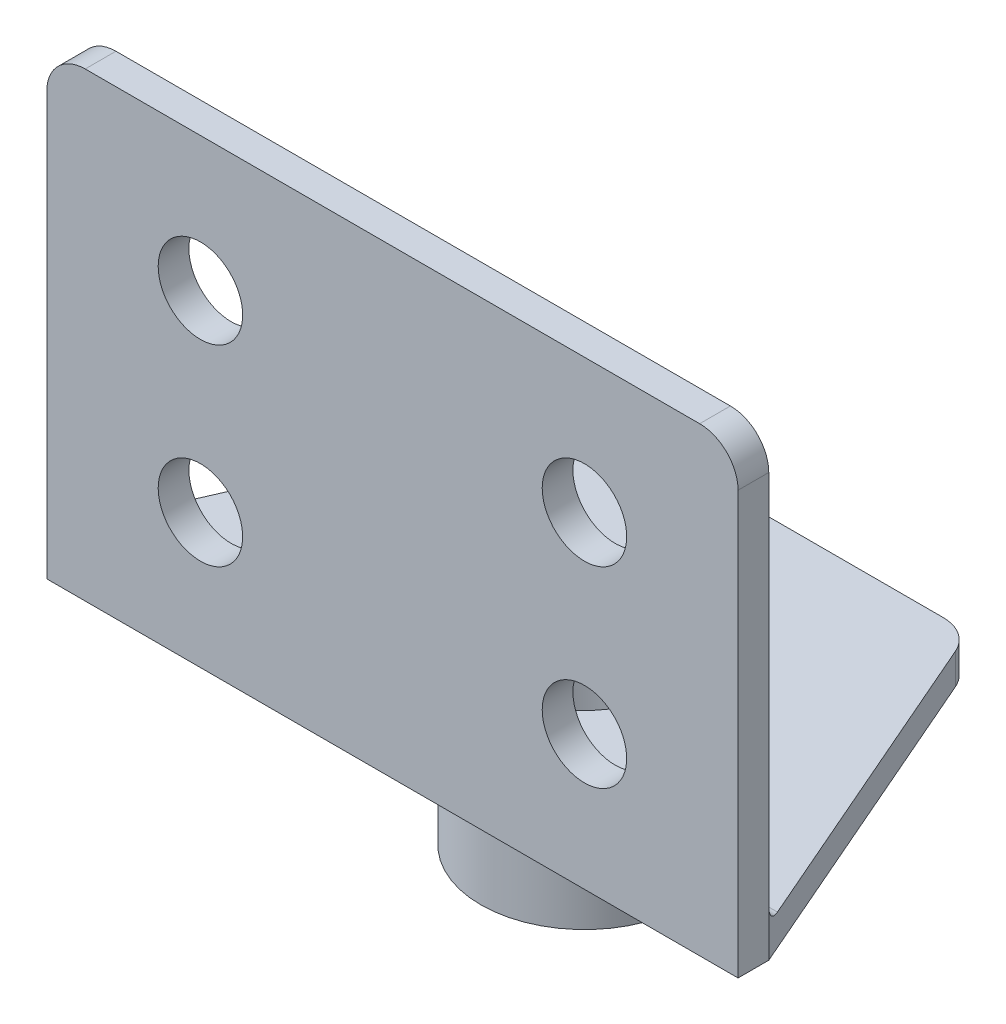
ISO-10303-21;
HEADER;
FILE_DESCRIPTION(('STEP AP214'),'2;1');
FILE_NAME('part.step','',(''),(''),'','','');
FILE_SCHEMA(('AUTOMOTIVE_DESIGN { 1 0 10303 214 1 1 1 1 }'));
ENDSEC;
DATA;
#1=APPLICATION_CONTEXT('core data for automotive mechanical design processes');
#2=APPLICATION_PROTOCOL_DEFINITION('international standard','automotive_design',2000,#1);
#3=PRODUCT_CONTEXT('',#1,'mechanical');
#4=PRODUCT('Part','Part','',(#3));
#5=PRODUCT_RELATED_PRODUCT_CATEGORY('part','',(#4));
#6=PRODUCT_DEFINITION_FORMATION('','',#4);
#7=PRODUCT_DEFINITION_CONTEXT('part definition',#1,'design');
#8=PRODUCT_DEFINITION('design','',#6,#7);
#9=PRODUCT_DEFINITION_SHAPE('','',#8);
#10=(LENGTH_UNIT() NAMED_UNIT(*) SI_UNIT(.MILLI.,.METRE.));
#11=(NAMED_UNIT(*) PLANE_ANGLE_UNIT() SI_UNIT($,.RADIAN.));
#12=(NAMED_UNIT(*) SI_UNIT($,.STERADIAN.) SOLID_ANGLE_UNIT());
#13=UNCERTAINTY_MEASURE_WITH_UNIT(LENGTH_MEASURE(1.E-05),#10,'distance_accuracy_value','');
#14=(GEOMETRIC_REPRESENTATION_CONTEXT(3) GLOBAL_UNCERTAINTY_ASSIGNED_CONTEXT((#13)) GLOBAL_UNIT_ASSIGNED_CONTEXT((#10,
#11,#12)) REPRESENTATION_CONTEXT('',''));
#15=CARTESIAN_POINT('',(0.,0.,0.));
#16=DIRECTION('',(0.,0.,1.));
#17=DIRECTION('',(1.,0.,0.));
#18=AXIS2_PLACEMENT_3D('',#15,#16,#17);
#19=CARTESIAN_POINT('',(45.,0.,-25.));
#20=DIRECTION('',(0.,1.,0.));
#21=DIRECTION('',(0.,0.,1.));
#22=AXIS2_PLACEMENT_3D('',#19,#20,#21);
#23=PLANE('',#22);
#24=CARTESIAN_POINT('',(0.,0.,0.));
#25=DIRECTION('',(0.,1.,0.));
#26=DIRECTION('',(0.,0.,1.));
#27=AXIS2_PLACEMENT_3D('',#24,#25,#26);
#28=CIRCLE('',#27,15.5);
#29=CARTESIAN_POINT('',(0.,0.,15.5));
#30=VERTEX_POINT('',#29);
#31=EDGE_CURVE('E11',#30,#30,#28,.T.);
#32=ORIENTED_EDGE('',*,*,#31,.T.);
#33=EDGE_LOOP('',(#32));
#34=FACE_BOUND('',#33,.T.);
#35=CARTESIAN_POINT('',(21.7217668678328,0.,-20.));
#36=DIRECTION('',(0.,1.,0.));
#37=DIRECTION('',(0.,0.,1.));
#38=AXIS2_PLACEMENT_3D('',#35,#36,#37);
#39=CIRCLE('',#38,5.);
#40=CARTESIAN_POINT('',(21.7217668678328,0.,-25.));
#41=VERTEX_POINT('',#40);
#42=CARTESIAN_POINT('',(26.307117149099,0.,-21.9936305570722));
#43=VERTEX_POINT('',#42);
#44=EDGE_CURVE('E178',#41,#43,#39,.F.);
#45=ORIENTED_EDGE('',*,*,#44,.T.);
#46=DIRECTION('',(0.39872611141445,0.,0.917070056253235));
#47=VECTOR('',#46,1.);
#48=CARTESIAN_POINT('',(28.1796502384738,0.,-17.6868044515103));
#49=LINE('',#48,#47);
#50=CARTESIAN_POINT('',(45.,0.,21.));
#51=VERTEX_POINT('',#50);
#52=EDGE_CURVE('E174',#43,#51,#49,.T.);
#53=ORIENTED_EDGE('',*,*,#52,.T.);
#54=DIRECTION('',(0.,0.,-1.));
#55=VECTOR('',#54,1.);
#56=CARTESIAN_POINT('',(45.,0.,-25.));
#57=LINE('',#56,#55);
#58=CARTESIAN_POINT('',(45.,0.,25.));
#59=VERTEX_POINT('',#58);
#60=EDGE_CURVE('E182',#59,#51,#57,.T.);
#61=ORIENTED_EDGE('',*,*,#60,.F.);
#62=DIRECTION('',(-1.,0.,0.));
#63=VECTOR('',#62,1.);
#64=CARTESIAN_POINT('',(45.,0.,25.));
#65=LINE('',#64,#63);
#66=CARTESIAN_POINT('',(-45.,0.,25.));
#67=VERTEX_POINT('',#66);
#68=EDGE_CURVE('E189',#59,#67,#65,.T.);
#69=ORIENTED_EDGE('',*,*,#68,.T.);
#70=DIRECTION('',(0.,0.,-1.));
#71=VECTOR('',#70,1.);
#72=CARTESIAN_POINT('',(-45.,0.,-25.));
#73=LINE('',#72,#71);
#74=CARTESIAN_POINT('',(-45.,0.,21.));
#75=VERTEX_POINT('',#74);
#76=EDGE_CURVE('E181',#67,#75,#73,.T.);
#77=ORIENTED_EDGE('',*,*,#76,.T.);
#78=DIRECTION('',(0.39872611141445,0.,-0.917070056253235));
#79=VECTOR('',#78,1.);
#80=CARTESIAN_POINT('',(-13.8712241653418,0.,-50.5961844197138));
#81=LINE('',#80,#79);
#82=CARTESIAN_POINT('',(-26.307117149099,0.,-21.9936305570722));
#83=VERTEX_POINT('',#82);
#84=EDGE_CURVE('E169',#75,#83,#81,.T.);
#85=ORIENTED_EDGE('',*,*,#84,.T.);
#86=CARTESIAN_POINT('',(-21.7217668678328,0.,-20.));
#87=DIRECTION('',(0.,1.,0.));
#88=DIRECTION('',(0.,0.,1.));
#89=AXIS2_PLACEMENT_3D('',#86,#87,#88);
#90=CIRCLE('',#89,5.);
#91=CARTESIAN_POINT('',(-21.7217668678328,0.,-25.));
#92=VERTEX_POINT('',#91);
#93=EDGE_CURVE('E150',#83,#92,#90,.F.);
#94=ORIENTED_EDGE('',*,*,#93,.T.);
#95=DIRECTION('',(-1.,0.,0.));
#96=VECTOR('',#95,1.);
#97=CARTESIAN_POINT('',(45.,0.,-25.));
#98=LINE('',#97,#96);
#99=EDGE_CURVE('E203',#41,#92,#98,.T.);
#100=ORIENTED_EDGE('',*,*,#99,.F.);
#101=EDGE_LOOP('',(#45,#53,#61,#69,#77,#85,#94,#100));
#102=FACE_BOUND('',#101,.T.);
#103=ADVANCED_FACE('F39',(#34,#102),#23,.F.);
#104=CARTESIAN_POINT('',(45.,4.00000000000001,-25.));
#105=DIRECTION('',(0.,0.,1.));
#106=DIRECTION('',(1.,0.,0.));
#107=AXIS2_PLACEMENT_3D('',#104,#105,#106);
#108=PLANE('',#107);
#109=DIRECTION('',(-1.,0.,0.));
#110=VECTOR('',#109,1.);
#111=CARTESIAN_POINT('',(45.,4.00000000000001,-25.));
#112=LINE('',#111,#110);
#113=CARTESIAN_POINT('',(21.7217668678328,4.00000000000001,-25.));
#114=VERTEX_POINT('',#113);
#115=CARTESIAN_POINT('',(-21.7217668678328,4.00000000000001,-25.));
#116=VERTEX_POINT('',#115);
#117=EDGE_CURVE('E158',#114,#116,#112,.T.);
#118=ORIENTED_EDGE('',*,*,#117,.F.);
#119=DIRECTION('',(0.,1.,0.));
#120=VECTOR('',#119,1.);
#121=CARTESIAN_POINT('',(21.7217668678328,-86.,-25.));
#122=LINE('',#121,#120);
#123=EDGE_CURVE('E170',#41,#114,#122,.T.);
#124=ORIENTED_EDGE('',*,*,#123,.F.);
#125=ORIENTED_EDGE('',*,*,#99,.T.);
#126=DIRECTION('',(0.,1.,0.));
#127=VECTOR('',#126,1.);
#128=CARTESIAN_POINT('',(-21.7217668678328,-86.,-25.));
#129=LINE('',#128,#127);
#130=EDGE_CURVE('E151',#92,#116,#129,.T.);
#131=ORIENTED_EDGE('',*,*,#130,.T.);
#132=EDGE_LOOP('',(#118,#124,#125,#131));
#133=FACE_BOUND('',#132,.T.);
#134=ADVANCED_FACE('F267',(#133),#108,.F.);
#135=CARTESIAN_POINT('',(45.,4.00000000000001,21.));
#136=DIRECTION('',(0.,-1.,0.));
#137=DIRECTION('',(0.,0.,-1.));
#138=AXIS2_PLACEMENT_3D('',#135,#136,#137);
#139=PLANE('',#138);
#140=CARTESIAN_POINT('',(0.,4.00000000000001,0.));
#141=DIRECTION('',(0.,1.,0.));
#142=DIRECTION('',(0.,0.,1.));
#143=AXIS2_PLACEMENT_3D('',#140,#141,#142);
#144=CIRCLE('',#143,12.5);
#145=CARTESIAN_POINT('',(0.,4.00000000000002,12.5));
#146=VERTEX_POINT('',#145);
#147=EDGE_CURVE('E144',#146,#146,#144,.T.);
#148=ORIENTED_EDGE('',*,*,#147,.F.);
#149=EDGE_LOOP('',(#148));
#150=FACE_BOUND('',#149,.T.);
#151=DIRECTION('',(0.39872611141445,0.,-0.917070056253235));
#152=VECTOR('',#151,1.);
#153=CARTESIAN_POINT('',(-45.,4.00000000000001,21.));
#154=LINE('',#153,#152);
#155=CARTESIAN_POINT('',(-44.1304347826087,4.00000000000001,19.));
#156=VERTEX_POINT('',#155);
#157=CARTESIAN_POINT('',(-26.307117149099,4.00000000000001,-21.9936305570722));
#158=VERTEX_POINT('',#157);
#159=EDGE_CURVE('E135',#156,#158,#154,.T.);
#160=ORIENTED_EDGE('',*,*,#159,.F.);
#161=DIRECTION('',(-1.,0.,0.));
#162=VECTOR('',#161,1.);
#163=CARTESIAN_POINT('',(45.,4.00000000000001,19.));
#164=LINE('',#163,#162);
#165=CARTESIAN_POINT('',(44.1304347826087,4.00000000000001,19.));
#166=VERTEX_POINT('',#165);
#167=EDGE_CURVE('E229',#156,#166,#164,.F.);
#168=ORIENTED_EDGE('',*,*,#167,.T.);
#169=DIRECTION('',(0.39872611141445,0.,0.917070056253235));
#170=VECTOR('',#169,1.);
#171=CARTESIAN_POINT('',(45.,4.00000000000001,21.));
#172=LINE('',#171,#170);
#173=CARTESIAN_POINT('',(26.307117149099,4.00000000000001,-21.9936305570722));
#174=VERTEX_POINT('',#173);
#175=EDGE_CURVE('E152',#174,#166,#172,.T.);
#176=ORIENTED_EDGE('',*,*,#175,.F.);
#177=CARTESIAN_POINT('',(21.7217668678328,4.00000000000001,-20.));
#178=DIRECTION('',(0.,-1.,0.));
#179=DIRECTION('',(0.,0.,1.));
#180=AXIS2_PLACEMENT_3D('',#177,#178,#179);
#181=CIRCLE('',#180,5.);
#182=EDGE_CURVE('E159',#114,#174,#181,.T.);
#183=ORIENTED_EDGE('',*,*,#182,.F.);
#184=ORIENTED_EDGE('',*,*,#117,.T.);
#185=CARTESIAN_POINT('',(-21.7217668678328,4.00000000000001,-20.));
#186=DIRECTION('',(0.,-1.,0.));
#187=DIRECTION('',(0.,0.,1.));
#188=AXIS2_PLACEMENT_3D('',#185,#186,#187);
#189=CIRCLE('',#188,5.);
#190=EDGE_CURVE('E143',#158,#116,#189,.T.);
#191=ORIENTED_EDGE('',*,*,#190,.F.);
#192=EDGE_LOOP('',(#160,#168,#176,#183,#184,#191));
#193=FACE_BOUND('',#192,.T.);
#194=ADVANCED_FACE('F155',(#150,#193),#139,.F.);
#195=CARTESIAN_POINT('',(45.,4.00000000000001,21.));
#196=DIRECTION('',(0.,0.,1.));
#197=DIRECTION('',(1.,0.,0.));
#198=AXIS2_PLACEMENT_3D('',#195,#196,#197);
#199=PLANE('',#198);
#200=CARTESIAN_POINT('',(25.,17.5,21.));
#201=DIRECTION('',(0.,0.,-1.));
#202=DIRECTION('',(-1.,0.,0.));
#203=AXIS2_PLACEMENT_3D('',#200,#201,#202);
#204=CIRCLE('',#203,5.5);
#205=CARTESIAN_POINT('',(19.5,17.5,21.));
#206=VERTEX_POINT('',#205);
#207=EDGE_CURVE('E457',#206,#206,#204,.T.);
#208=ORIENTED_EDGE('',*,*,#207,.F.);
#209=EDGE_LOOP('',(#208));
#210=FACE_BOUND('',#209,.T.);
#211=CARTESIAN_POINT('',(-25.,17.5,21.));
#212=DIRECTION('',(0.,0.,-1.));
#213=DIRECTION('',(-1.,0.,0.));
#214=AXIS2_PLACEMENT_3D('',#211,#212,#213);
#215=CIRCLE('',#214,5.5);
#216=CARTESIAN_POINT('',(-30.5,17.5,21.));
#217=VERTEX_POINT('',#216);
#218=EDGE_CURVE('E458',#217,#217,#215,.T.);
#219=ORIENTED_EDGE('',*,*,#218,.F.);
#220=EDGE_LOOP('',(#219));
#221=FACE_BOUND('',#220,.T.);
#222=CARTESIAN_POINT('',(-25.,42.5,21.));
#223=DIRECTION('',(0.,0.,-1.));
#224=DIRECTION('',(-1.,0.,0.));
#225=AXIS2_PLACEMENT_3D('',#222,#223,#224);
#226=CIRCLE('',#225,5.5);
#227=CARTESIAN_POINT('',(-30.5,42.5,21.));
#228=VERTEX_POINT('',#227);
#229=EDGE_CURVE('E460',#228,#228,#226,.T.);
#230=ORIENTED_EDGE('',*,*,#229,.F.);
#231=EDGE_LOOP('',(#230));
#232=FACE_BOUND('',#231,.T.);
#233=CARTESIAN_POINT('',(25.,42.5,21.));
#234=DIRECTION('',(0.,0.,-1.));
#235=DIRECTION('',(-1.,0.,0.));
#236=AXIS2_PLACEMENT_3D('',#233,#234,#235);
#237=CIRCLE('',#236,5.5);
#238=CARTESIAN_POINT('',(19.5,42.5,21.));
#239=VERTEX_POINT('',#238);
#240=EDGE_CURVE('E241',#239,#239,#237,.T.);
#241=ORIENTED_EDGE('',*,*,#240,.F.);
#242=EDGE_LOOP('',(#241));
#243=FACE_BOUND('',#242,.T.);
#244=DIRECTION('',(0.,1.,0.));
#245=VECTOR('',#244,1.);
#246=CARTESIAN_POINT('',(45.,4.00000000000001,21.));
#247=LINE('',#246,#245);
#248=CARTESIAN_POINT('',(45.,6.,21.));
#249=VERTEX_POINT('',#248);
#250=CARTESIAN_POINT('',(45.,55.,21.));
#251=VERTEX_POINT('',#250);
#252=EDGE_CURVE('E184',#249,#251,#247,.T.);
#253=ORIENTED_EDGE('',*,*,#252,.F.);
#254=DIRECTION('',(-1.,0.,0.));
#255=VECTOR('',#254,1.);
#256=CARTESIAN_POINT('',(-45.,6.00000000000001,21.));
#257=LINE('',#256,#255);
#258=CARTESIAN_POINT('',(-45.,6.00000000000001,21.));
#259=VERTEX_POINT('',#258);
#260=EDGE_CURVE('E227',#249,#259,#257,.T.);
#261=ORIENTED_EDGE('',*,*,#260,.T.);
#262=DIRECTION('',(0.,1.,0.));
#263=VECTOR('',#262,1.);
#264=CARTESIAN_POINT('',(-45.,4.00000000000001,21.));
#265=LINE('',#264,#263);
#266=CARTESIAN_POINT('',(-45.,55.,21.));
#267=VERTEX_POINT('',#266);
#268=EDGE_CURVE('E81',#259,#267,#265,.T.);
#269=ORIENTED_EDGE('',*,*,#268,.T.);
#270=CARTESIAN_POINT('',(-40.,55.,21.));
#271=DIRECTION('',(0.,0.,1.));
#272=DIRECTION('',(1.,0.,0.));
#273=AXIS2_PLACEMENT_3D('',#270,#271,#272);
#274=CIRCLE('',#273,5.);
#275=CARTESIAN_POINT('',(-40.,60.,21.));
#276=VERTEX_POINT('',#275);
#277=EDGE_CURVE('E220',#267,#276,#274,.F.);
#278=ORIENTED_EDGE('',*,*,#277,.T.);
#279=DIRECTION('',(-1.,0.,0.));
#280=VECTOR('',#279,1.);
#281=CARTESIAN_POINT('',(45.,60.,21.));
#282=LINE('',#281,#280);
#283=CARTESIAN_POINT('',(40.,60.,21.));
#284=VERTEX_POINT('',#283);
#285=EDGE_CURVE('E199',#284,#276,#282,.T.);
#286=ORIENTED_EDGE('',*,*,#285,.F.);
#287=CARTESIAN_POINT('',(40.,55.,21.));
#288=DIRECTION('',(0.,0.,1.));
#289=DIRECTION('',(1.,0.,0.));
#290=AXIS2_PLACEMENT_3D('',#287,#288,#289);
#291=CIRCLE('',#290,5.);
#292=EDGE_CURVE('E222',#284,#251,#291,.F.);
#293=ORIENTED_EDGE('',*,*,#292,.T.);
#294=EDGE_LOOP('',(#253,#261,#269,#278,#286,#293));
#295=FACE_BOUND('',#294,.T.);
#296=ADVANCED_FACE('F266',(#210,#221,#232,#243,#295),#199,.F.);
#297=CARTESIAN_POINT('',(45.,60.,25.));
#298=DIRECTION('',(0.,-1.,0.));
#299=DIRECTION('',(0.,0.,-1.));
#300=AXIS2_PLACEMENT_3D('',#297,#298,#299);
#301=PLANE('',#300);
#302=DIRECTION('',(-1.,0.,0.));
#303=VECTOR('',#302,1.);
#304=CARTESIAN_POINT('',(45.,60.,25.));
#305=LINE('',#304,#303);
#306=CARTESIAN_POINT('',(40.,60.,25.));
#307=VERTEX_POINT('',#306);
#308=CARTESIAN_POINT('',(-40.,60.,25.));
#309=VERTEX_POINT('',#308);
#310=EDGE_CURVE('E196',#307,#309,#305,.T.);
#311=ORIENTED_EDGE('',*,*,#310,.F.);
#312=DIRECTION('',(0.,0.,1.));
#313=VECTOR('',#312,1.);
#314=CARTESIAN_POINT('',(40.,60.,25.));
#315=LINE('',#314,#313);
#316=EDGE_CURVE('E218',#307,#284,#315,.F.);
#317=ORIENTED_EDGE('',*,*,#316,.T.);
#318=ORIENTED_EDGE('',*,*,#285,.T.);
#319=DIRECTION('',(0.,0.,1.));
#320=VECTOR('',#319,1.);
#321=CARTESIAN_POINT('',(-40.,60.,25.));
#322=LINE('',#321,#320);
#323=EDGE_CURVE('E215',#276,#309,#322,.T.);
#324=ORIENTED_EDGE('',*,*,#323,.T.);
#325=EDGE_LOOP('',(#311,#317,#318,#324));
#326=FACE_BOUND('',#325,.T.);
#327=ADVANCED_FACE('F274',(#326),#301,.F.);
#328=CARTESIAN_POINT('',(45.,0.,25.));
#329=DIRECTION('',(0.,0.,-1.));
#330=DIRECTION('',(-1.,0.,0.));
#331=AXIS2_PLACEMENT_3D('',#328,#329,#330);
#332=PLANE('',#331);
#333=CARTESIAN_POINT('',(25.,17.5,25.));
#334=DIRECTION('',(0.,0.,-1.));
#335=DIRECTION('',(-1.,0.,0.));
#336=AXIS2_PLACEMENT_3D('',#333,#334,#335);
#337=CIRCLE('',#336,5.5);
#338=CARTESIAN_POINT('',(19.5,17.5,25.));
#339=VERTEX_POINT('',#338);
#340=EDGE_CURVE('E43',#339,#339,#337,.T.);
#341=ORIENTED_EDGE('',*,*,#340,.T.);
#342=EDGE_LOOP('',(#341));
#343=FACE_BOUND('',#342,.T.);
#344=CARTESIAN_POINT('',(-25.,17.5,25.));
#345=DIRECTION('',(0.,0.,-1.));
#346=DIRECTION('',(-1.,0.,0.));
#347=AXIS2_PLACEMENT_3D('',#344,#345,#346);
#348=CIRCLE('',#347,5.5);
#349=CARTESIAN_POINT('',(-30.5,17.5,25.));
#350=VERTEX_POINT('',#349);
#351=EDGE_CURVE('E243',#350,#350,#348,.T.);
#352=ORIENTED_EDGE('',*,*,#351,.T.);
#353=EDGE_LOOP('',(#352));
#354=FACE_BOUND('',#353,.T.);
#355=CARTESIAN_POINT('',(-25.,42.5,25.));
#356=DIRECTION('',(0.,0.,-1.));
#357=DIRECTION('',(-1.,0.,0.));
#358=AXIS2_PLACEMENT_3D('',#355,#356,#357);
#359=CIRCLE('',#358,5.5);
#360=CARTESIAN_POINT('',(-30.5,42.5,25.));
#361=VERTEX_POINT('',#360);
#362=EDGE_CURVE('E240',#361,#361,#359,.T.);
#363=ORIENTED_EDGE('',*,*,#362,.T.);
#364=EDGE_LOOP('',(#363));
#365=FACE_BOUND('',#364,.T.);
#366=CARTESIAN_POINT('',(25.,42.5,25.));
#367=DIRECTION('',(0.,0.,-1.));
#368=DIRECTION('',(-1.,0.,0.));
#369=AXIS2_PLACEMENT_3D('',#366,#367,#368);
#370=CIRCLE('',#369,5.5);
#371=CARTESIAN_POINT('',(19.5,42.5,25.));
#372=VERTEX_POINT('',#371);
#373=EDGE_CURVE('E237',#372,#372,#370,.T.);
#374=ORIENTED_EDGE('',*,*,#373,.T.);
#375=EDGE_LOOP('',(#374));
#376=FACE_BOUND('',#375,.T.);
#377=DIRECTION('',(0.,-1.,0.));
#378=VECTOR('',#377,1.);
#379=CARTESIAN_POINT('',(45.,0.,25.));
#380=LINE('',#379,#378);
#381=CARTESIAN_POINT('',(45.,55.,25.));
#382=VERTEX_POINT('',#381);
#383=EDGE_CURVE('E187',#382,#59,#380,.T.);
#384=ORIENTED_EDGE('',*,*,#383,.F.);
#385=CARTESIAN_POINT('',(40.,55.,25.));
#386=DIRECTION('',(0.,0.,-1.));
#387=DIRECTION('',(-1.,0.,0.));
#388=AXIS2_PLACEMENT_3D('',#385,#386,#387);
#389=CIRCLE('',#388,5.);
#390=EDGE_CURVE('E213',#382,#307,#389,.F.);
#391=ORIENTED_EDGE('',*,*,#390,.T.);
#392=ORIENTED_EDGE('',*,*,#310,.T.);
#393=CARTESIAN_POINT('',(-40.,55.,25.));
#394=DIRECTION('',(0.,0.,-1.));
#395=DIRECTION('',(-1.,0.,0.));
#396=AXIS2_PLACEMENT_3D('',#393,#394,#395);
#397=CIRCLE('',#396,5.);
#398=CARTESIAN_POINT('',(-45.,55.,25.));
#399=VERTEX_POINT('',#398);
#400=EDGE_CURVE('E211',#309,#399,#397,.F.);
#401=ORIENTED_EDGE('',*,*,#400,.T.);
#402=DIRECTION('',(0.,-1.,0.));
#403=VECTOR('',#402,1.);
#404=CARTESIAN_POINT('',(-45.,0.,25.));
#405=LINE('',#404,#403);
#406=EDGE_CURVE('E185',#399,#67,#405,.T.);
#407=ORIENTED_EDGE('',*,*,#406,.T.);
#408=ORIENTED_EDGE('',*,*,#68,.F.);
#409=EDGE_LOOP('',(#384,#391,#392,#401,#407,#408));
#410=FACE_BOUND('',#409,.T.);
#411=ADVANCED_FACE('F332',(#343,#354,#365,#376,#410),#332,.F.);
#412=CARTESIAN_POINT('',(45.,0.,0.));
#413=DIRECTION('',(-1.,0.,0.));
#414=DIRECTION('',(0.,0.,1.));
#415=AXIS2_PLACEMENT_3D('',#412,#413,#414);
#416=PLANE('',#415);
#417=DIRECTION('',(0.,1.,0.));
#418=VECTOR('',#417,1.);
#419=CARTESIAN_POINT('',(45.,0.,21.));
#420=LINE('',#419,#418);
#421=EDGE_CURVE('E56',#51,#249,#420,.T.);
#422=ORIENTED_EDGE('',*,*,#421,.T.);
#423=ORIENTED_EDGE('',*,*,#252,.T.);
#424=DIRECTION('',(0.,0.,1.));
#425=VECTOR('',#424,1.);
#426=CARTESIAN_POINT('',(45.,55.,0.));
#427=LINE('',#426,#425);
#428=EDGE_CURVE('E208',#251,#382,#427,.T.);
#429=ORIENTED_EDGE('',*,*,#428,.T.);
#430=ORIENTED_EDGE('',*,*,#383,.T.);
#431=ORIENTED_EDGE('',*,*,#60,.T.);
#432=EDGE_LOOP('',(#422,#423,#429,#430,#431));
#433=FACE_BOUND('',#432,.T.);
#434=ADVANCED_FACE('F328',(#433),#416,.F.);
#435=CARTESIAN_POINT('',(-45.,0.,0.));
#436=DIRECTION('',(-1.,0.,0.));
#437=DIRECTION('',(0.,0.,1.));
#438=AXIS2_PLACEMENT_3D('',#435,#436,#437);
#439=PLANE('',#438);
#440=ORIENTED_EDGE('',*,*,#406,.F.);
#441=DIRECTION('',(0.,0.,1.));
#442=VECTOR('',#441,1.);
#443=CARTESIAN_POINT('',(-45.,55.,21.));
#444=LINE('',#443,#442);
#445=EDGE_CURVE('E225',#399,#267,#444,.F.);
#446=ORIENTED_EDGE('',*,*,#445,.T.);
#447=ORIENTED_EDGE('',*,*,#268,.F.);
#448=DIRECTION('',(0.,1.,0.));
#449=VECTOR('',#448,1.);
#450=CARTESIAN_POINT('',(-45.,0.,21.));
#451=LINE('',#450,#449);
#452=EDGE_CURVE('E74',#75,#259,#451,.T.);
#453=ORIENTED_EDGE('',*,*,#452,.F.);
#454=ORIENTED_EDGE('',*,*,#76,.F.);
#455=EDGE_LOOP('',(#440,#446,#447,#453,#454));
#456=FACE_BOUND('',#455,.T.);
#457=ADVANCED_FACE('F318',(#456),#439,.T.);
#458=CARTESIAN_POINT('',(-45.,-86.,21.));
#459=DIRECTION('',(0.917070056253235,0.,0.39872611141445));
#460=DIRECTION('',(0.39872611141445,0.,-0.917070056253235));
#461=AXIS2_PLACEMENT_3D('',#458,#459,#460);
#462=PLANE('',#461);
#463=ORIENTED_EDGE('',*,*,#452,.T.);
#464=CARTESIAN_POINT('',(-44.1304347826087,6.00000000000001,19.));
#465=DIRECTION('',(0.917070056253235,0.,0.39872611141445));
#466=DIRECTION('',(0.39872611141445,0.,-0.917070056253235));
#467=AXIS2_PLACEMENT_3D('',#464,#465,#466);
#468=ELLIPSE('',#467,2.18085847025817,2.);
#469=EDGE_CURVE('E65',#259,#156,#468,.T.);
#470=ORIENTED_EDGE('',*,*,#469,.T.);
#471=ORIENTED_EDGE('',*,*,#159,.T.);
#472=DIRECTION('',(0.,1.,0.));
#473=VECTOR('',#472,1.);
#474=CARTESIAN_POINT('',(-26.307117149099,-86.,-21.9936305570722));
#475=LINE('',#474,#473);
#476=EDGE_CURVE('E138',#83,#158,#475,.T.);
#477=ORIENTED_EDGE('',*,*,#476,.F.);
#478=ORIENTED_EDGE('',*,*,#84,.F.);
#479=EDGE_LOOP('',(#463,#470,#471,#477,#478));
#480=FACE_BOUND('',#479,.T.);
#481=ADVANCED_FACE('F137',(#480),#462,.F.);
#482=CARTESIAN_POINT('',(-21.7217668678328,-86.,-20.));
#483=DIRECTION('',(0.,1.,0.));
#484=DIRECTION('',(0.,0.,1.));
#485=AXIS2_PLACEMENT_3D('',#482,#483,#484);
#486=CYLINDRICAL_SURFACE('',#485,5.);
#487=ORIENTED_EDGE('',*,*,#476,.T.);
#488=ORIENTED_EDGE('',*,*,#190,.T.);
#489=ORIENTED_EDGE('',*,*,#130,.F.);
#490=ORIENTED_EDGE('',*,*,#93,.F.);
#491=EDGE_LOOP('',(#487,#488,#489,#490));
#492=FACE_BOUND('',#491,.T.);
#493=ADVANCED_FACE('F147',(#492),#486,.T.);
#494=CARTESIAN_POINT('',(21.7217668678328,-86.,-20.));
#495=DIRECTION('',(0.,1.,0.));
#496=DIRECTION('',(0.,0.,1.));
#497=AXIS2_PLACEMENT_3D('',#494,#495,#496);
#498=CYLINDRICAL_SURFACE('',#497,5.);
#499=ORIENTED_EDGE('',*,*,#123,.T.);
#500=ORIENTED_EDGE('',*,*,#182,.T.);
#501=DIRECTION('',(0.,1.,0.));
#502=VECTOR('',#501,1.);
#503=CARTESIAN_POINT('',(26.307117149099,-86.,-21.9936305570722));
#504=LINE('',#503,#502);
#505=EDGE_CURVE('E167',#43,#174,#504,.T.);
#506=ORIENTED_EDGE('',*,*,#505,.F.);
#507=ORIENTED_EDGE('',*,*,#44,.F.);
#508=EDGE_LOOP('',(#499,#500,#506,#507));
#509=FACE_BOUND('',#508,.T.);
#510=ADVANCED_FACE('F334',(#509),#498,.T.);
#511=CARTESIAN_POINT('',(45.,-86.,21.));
#512=DIRECTION('',(-0.917070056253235,0.,0.39872611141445));
#513=DIRECTION('',(0.39872611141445,0.,0.917070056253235));
#514=AXIS2_PLACEMENT_3D('',#511,#512,#513);
#515=PLANE('',#514);
#516=ORIENTED_EDGE('',*,*,#505,.T.);
#517=ORIENTED_EDGE('',*,*,#175,.T.);
#518=CARTESIAN_POINT('',(44.1304347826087,6.00000000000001,19.));
#519=DIRECTION('',(-0.917070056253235,0.,0.39872611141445));
#520=DIRECTION('',(0.39872611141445,0.,0.917070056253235));
#521=AXIS2_PLACEMENT_3D('',#518,#519,#520);
#522=ELLIPSE('',#521,2.18085847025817,2.);
#523=EDGE_CURVE('E232',#166,#249,#522,.T.);
#524=ORIENTED_EDGE('',*,*,#523,.T.);
#525=ORIENTED_EDGE('',*,*,#421,.F.);
#526=ORIENTED_EDGE('',*,*,#52,.F.);
#527=EDGE_LOOP('',(#516,#517,#524,#525,#526));
#528=FACE_BOUND('',#527,.T.);
#529=ADVANCED_FACE('F309',(#528),#515,.F.);
#530=CARTESIAN_POINT('',(0.,-86.,0.));
#531=DIRECTION('',(0.,1.,0.));
#532=DIRECTION('',(0.,0.,1.));
#533=AXIS2_PLACEMENT_3D('',#530,#531,#532);
#534=CYLINDRICAL_SURFACE('',#533,12.5);
#535=CARTESIAN_POINT('',(0.,-20.,0.));
#536=DIRECTION('',(0.,-1.,0.));
#537=DIRECTION('',(0.,0.,-1.));
#538=AXIS2_PLACEMENT_3D('',#535,#536,#537);
#539=CIRCLE('',#538,12.5);
#540=CARTESIAN_POINT('',(0.,-20.,12.5));
#541=VERTEX_POINT('',#540);
#542=EDGE_CURVE('E248',#541,#541,#539,.T.);
#543=CARTESIAN_POINT('',(0.,4.00000000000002,12.5));
#544=CARTESIAN_POINT('',(0.,3.75000000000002,12.5));
#545=CARTESIAN_POINT('',(0.,3.50000000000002,12.5));
#546=CARTESIAN_POINT('',(0.,3.00000000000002,12.5));
#547=CARTESIAN_POINT('',(0.,2.75000000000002,12.5));
#548=CARTESIAN_POINT('',(0.,2.25000000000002,12.5));
#549=CARTESIAN_POINT('',(0.,2.00000000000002,12.5));
#550=CARTESIAN_POINT('',(0.,1.50000000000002,12.5));
#551=CARTESIAN_POINT('',(0.,1.25000000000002,12.5));
#552=CARTESIAN_POINT('',(0.,0.750000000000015,12.5));
#553=CARTESIAN_POINT('',(0.,0.500000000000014,12.5));
#554=CARTESIAN_POINT('',(0.,0.,12.5));
#555=CARTESIAN_POINT('',(0.,-0.249999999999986,12.5));
#556=CARTESIAN_POINT('',(0.,-0.749999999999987,12.5));
#557=CARTESIAN_POINT('',(0.,-0.999999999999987,12.5));
#558=CARTESIAN_POINT('',(0.,-1.49999999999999,12.5));
#559=CARTESIAN_POINT('',(0.,-1.74999999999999,12.5));
#560=CARTESIAN_POINT('',(0.,-2.24999999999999,12.5));
#561=CARTESIAN_POINT('',(0.,-2.49999999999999,12.5));
#562=CARTESIAN_POINT('',(0.,-2.99999999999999,12.5));
#563=CARTESIAN_POINT('',(0.,-3.24999999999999,12.5));
#564=CARTESIAN_POINT('',(0.,-3.74999999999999,12.5));
#565=CARTESIAN_POINT('',(0.,-3.99999999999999,12.5));
#566=CARTESIAN_POINT('',(0.,-4.49999999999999,12.5));
#567=CARTESIAN_POINT('',(0.,-4.74999999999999,12.5));
#568=CARTESIAN_POINT('',(0.,-5.24999999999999,12.5));
#569=CARTESIAN_POINT('',(0.,-5.49999999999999,12.5));
#570=CARTESIAN_POINT('',(0.,-5.99999999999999,12.5));
#571=CARTESIAN_POINT('',(0.,-6.24999999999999,12.5));
#572=CARTESIAN_POINT('',(0.,-6.74999999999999,12.5));
#573=CARTESIAN_POINT('',(0.,-6.99999999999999,12.5));
#574=CARTESIAN_POINT('',(0.,-7.49999999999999,12.5));
#575=CARTESIAN_POINT('',(0.,-7.74999999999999,12.5));
#576=CARTESIAN_POINT('',(0.,-8.24999999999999,12.5));
#577=CARTESIAN_POINT('',(0.,-8.49999999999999,12.5));
#578=CARTESIAN_POINT('',(0.,-8.99999999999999,12.5));
#579=CARTESIAN_POINT('',(0.,-9.24999999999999,12.5));
#580=CARTESIAN_POINT('',(0.,-9.74999999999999,12.5));
#581=CARTESIAN_POINT('',(0.,-9.99999999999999,12.5));
#582=CARTESIAN_POINT('',(0.,-10.5,12.5));
#583=CARTESIAN_POINT('',(0.,-10.75,12.5));
#584=CARTESIAN_POINT('',(0.,-11.25,12.5));
#585=CARTESIAN_POINT('',(0.,-11.5,12.5));
#586=CARTESIAN_POINT('',(0.,-12.,12.5));
#587=CARTESIAN_POINT('',(0.,-12.25,12.5));
#588=CARTESIAN_POINT('',(0.,-12.75,12.5));
#589=CARTESIAN_POINT('',(0.,-13.,12.5));
#590=CARTESIAN_POINT('',(0.,-13.5,12.5));
#591=CARTESIAN_POINT('',(0.,-13.75,12.5));
#592=CARTESIAN_POINT('',(0.,-14.25,12.5));
#593=CARTESIAN_POINT('',(0.,-14.5,12.5));
#594=CARTESIAN_POINT('',(0.,-15.,12.5));
#595=CARTESIAN_POINT('',(0.,-15.25,12.5));
#596=CARTESIAN_POINT('',(0.,-15.75,12.5));
#597=CARTESIAN_POINT('',(0.,-16.,12.5));
#598=CARTESIAN_POINT('',(0.,-16.5,12.5));
#599=CARTESIAN_POINT('',(0.,-16.75,12.5));
#600=CARTESIAN_POINT('',(0.,-17.25,12.5));
#601=CARTESIAN_POINT('',(0.,-17.5,12.5));
#602=CARTESIAN_POINT('',(0.,-18.,12.5));
#603=CARTESIAN_POINT('',(0.,-18.25,12.5));
#604=CARTESIAN_POINT('',(0.,-18.75,12.5));
#605=CARTESIAN_POINT('',(0.,-19.,12.5));
#606=CARTESIAN_POINT('',(0.,-19.5,12.5));
#607=CARTESIAN_POINT('',(0.,-19.75,12.5));
#608=CARTESIAN_POINT('',(0.,-20.,12.5));
#609=B_SPLINE_CURVE_WITH_KNOTS('',3,(#543,#544,#545,#546,#547,#548,#549,#550,#551,#552,#553,
#554,#555,#556,#557,#558,#559,#560,#561,#562,#563,#564,#565,#566,#567,#568,#569,#570,#571,#572,
#573,#574,#575,#576,#577,#578,#579,#580,#581,#582,#583,#584,#585,#586,#587,#588,#589,#590,#591,
#592,#593,#594,#595,#596,#597,#598,#599,#600,#601,#602,#603,#604,#605,#606,#607,#608),
.UNSPECIFIED.,.F.,.F.,(4,2,2,2,2,2,2,2,2,2,2,2,2,2,2,2,2,2,2,2,2,2,2,2,2,2,2,2,2,2,2,2,4),(0.,
0.750000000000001,1.5,2.25,3.,3.75,4.5,5.25,6.00000000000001,6.75000000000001,7.50000000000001,
8.25000000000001,9.00000000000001,9.75000000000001,10.5,11.25,12.,12.75,13.5,14.25,15.,15.75,
16.5,17.25,18.,18.75,19.5,20.25,21.,21.75,22.5,23.25,24.),.UNSPECIFIED.);
#610=EDGE_CURVE('BSEAM263',#146,#541,#609,.T.);
#611=ORIENTED_EDGE('',*,*,#147,.T.);
#612=ORIENTED_EDGE('',*,*,#542,.T.);
#613=ORIENTED_EDGE('',*,*,#610,.T.);
#614=ORIENTED_EDGE('',*,*,#610,.F.);
#615=EDGE_LOOP('',(#611,#613,#612,#614));
#616=FACE_BOUND('',#615,.T.);
#617=ADVANCED_FACE('F263',(#616),#534,.F.);
#618=CARTESIAN_POINT('',(40.,55.,0.));
#619=DIRECTION('',(0.,0.,1.));
#620=DIRECTION('',(1.,0.,0.));
#621=AXIS2_PLACEMENT_3D('',#618,#619,#620);
#622=CYLINDRICAL_SURFACE('',#621,5.);
#623=ORIENTED_EDGE('',*,*,#292,.F.);
#624=ORIENTED_EDGE('',*,*,#316,.F.);
#625=ORIENTED_EDGE('',*,*,#390,.F.);
#626=ORIENTED_EDGE('',*,*,#428,.F.);
#627=EDGE_LOOP('',(#623,#624,#625,#626));
#628=FACE_BOUND('',#627,.T.);
#629=ADVANCED_FACE('F289',(#628),#622,.T.);
#630=CARTESIAN_POINT('',(-40.,55.,25.));
#631=DIRECTION('',(0.,0.,-1.));
#632=DIRECTION('',(-1.,0.,0.));
#633=AXIS2_PLACEMENT_3D('',#630,#631,#632);
#634=CYLINDRICAL_SURFACE('',#633,5.);
#635=ORIENTED_EDGE('',*,*,#277,.F.);
#636=ORIENTED_EDGE('',*,*,#445,.F.);
#637=ORIENTED_EDGE('',*,*,#400,.F.);
#638=ORIENTED_EDGE('',*,*,#323,.F.);
#639=EDGE_LOOP('',(#635,#636,#637,#638));
#640=FACE_BOUND('',#639,.T.);
#641=ADVANCED_FACE('F292',(#640),#634,.T.);
#642=CARTESIAN_POINT('',(45.,6.00000000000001,19.));
#643=DIRECTION('',(1.,0.,0.));
#644=DIRECTION('',(0.,0.,-1.));
#645=AXIS2_PLACEMENT_3D('',#642,#643,#644);
#646=CYLINDRICAL_SURFACE('',#645,2.);
#647=ORIENTED_EDGE('',*,*,#523,.F.);
#648=ORIENTED_EDGE('',*,*,#167,.F.);
#649=ORIENTED_EDGE('',*,*,#469,.F.);
#650=ORIENTED_EDGE('',*,*,#260,.F.);
#651=EDGE_LOOP('',(#647,#648,#649,#650));
#652=FACE_BOUND('',#651,.T.);
#653=ADVANCED_FACE('F295',(#652),#646,.F.);
#654=CARTESIAN_POINT('',(0.,-20.,0.));
#655=DIRECTION('',(0.,-1.,0.));
#656=DIRECTION('',(0.,0.,-1.));
#657=AXIS2_PLACEMENT_3D('',#654,#655,#656);
#658=PLANE('',#657);
#659=CARTESIAN_POINT('',(0.,-20.,0.));
#660=DIRECTION('',(0.,-1.,0.));
#661=DIRECTION('',(0.,0.,-1.));
#662=AXIS2_PLACEMENT_3D('',#659,#660,#661);
#663=CIRCLE('',#662,13.5);
#664=CARTESIAN_POINT('',(0.,-20.,-13.5));
#665=VERTEX_POINT('',#664);
#666=EDGE_CURVE('E252',#665,#665,#663,.T.);
#667=ORIENTED_EDGE('',*,*,#666,.T.);
#668=EDGE_LOOP('',(#667));
#669=FACE_BOUND('',#668,.T.);
#670=ORIENTED_EDGE('',*,*,#542,.F.);
#671=EDGE_LOOP('',(#670));
#672=FACE_BOUND('',#671,.T.);
#673=ADVANCED_FACE('F298',(#669,#672),#658,.T.);
#674=CARTESIAN_POINT('',(0.,-20.,0.));
#675=DIRECTION('',(0.,1.,0.));
#676=DIRECTION('',(0.,0.,1.));
#677=AXIS2_PLACEMENT_3D('',#674,#675,#676);
#678=CYLINDRICAL_SURFACE('',#677,13.5);
#679=CARTESIAN_POINT('',(0.,-2.,0.));
#680=DIRECTION('',(0.,1.,0.));
#681=DIRECTION('',(0.,0.,1.));
#682=AXIS2_PLACEMENT_3D('',#679,#680,#681);
#683=CIRCLE('',#682,13.5);
#684=CARTESIAN_POINT('',(0.,-2.,13.5));
#685=VERTEX_POINT('',#684);
#686=EDGE_CURVE('E48',#685,#685,#683,.F.);
#687=ORIENTED_EDGE('',*,*,#686,.T.);
#688=EDGE_LOOP('',(#687));
#689=FACE_BOUND('',#688,.T.);
#690=ORIENTED_EDGE('',*,*,#666,.F.);
#691=EDGE_LOOP('',(#690));
#692=FACE_BOUND('',#691,.T.);
#693=ADVANCED_FACE('F303',(#689,#692),#678,.T.);
#694=CARTESIAN_POINT('',(0.,-2.,0.));
#695=DIRECTION('',(0.,1.,0.));
#696=DIRECTION('',(0.,0.,1.));
#697=AXIS2_PLACEMENT_3D('',#694,#695,#696);
#698=TOROIDAL_SURFACE('',#697,15.5,2.);
#699=ORIENTED_EDGE('',*,*,#31,.F.);
#700=EDGE_LOOP('',(#699));
#701=FACE_BOUND('',#700,.T.);
#702=ORIENTED_EDGE('',*,*,#686,.F.);
#703=EDGE_LOOP('',(#702));
#704=FACE_BOUND('',#703,.T.);
#705=ADVANCED_FACE('F41',(#701,#704),#698,.F.);
#706=CARTESIAN_POINT('',(25.,42.5,46.));
#707=DIRECTION('',(0.,0.,-1.));
#708=DIRECTION('',(-1.,0.,0.));
#709=AXIS2_PLACEMENT_3D('',#706,#707,#708);
#710=CYLINDRICAL_SURFACE('',#709,5.5);
#711=ORIENTED_EDGE('',*,*,#240,.T.);
#712=EDGE_LOOP('',(#711));
#713=FACE_BOUND('',#712,.T.);
#714=ORIENTED_EDGE('',*,*,#373,.F.);
#715=EDGE_LOOP('',(#714));
#716=FACE_BOUND('',#715,.T.);
#717=ADVANCED_FACE('F410',(#713,#716),#710,.F.);
#718=CARTESIAN_POINT('',(-25.,42.5,46.));
#719=DIRECTION('',(0.,0.,-1.));
#720=DIRECTION('',(-1.,0.,0.));
#721=AXIS2_PLACEMENT_3D('',#718,#719,#720);
#722=CYLINDRICAL_SURFACE('',#721,5.5);
#723=ORIENTED_EDGE('',*,*,#229,.T.);
#724=EDGE_LOOP('',(#723));
#725=FACE_BOUND('',#724,.T.);
#726=ORIENTED_EDGE('',*,*,#362,.F.);
#727=EDGE_LOOP('',(#726));
#728=FACE_BOUND('',#727,.T.);
#729=ADVANCED_FACE('F418',(#725,#728),#722,.F.);
#730=CARTESIAN_POINT('',(-25.,17.5,46.));
#731=DIRECTION('',(0.,0.,-1.));
#732=DIRECTION('',(-1.,0.,0.));
#733=AXIS2_PLACEMENT_3D('',#730,#731,#732);
#734=CYLINDRICAL_SURFACE('',#733,5.5);
#735=ORIENTED_EDGE('',*,*,#218,.T.);
#736=EDGE_LOOP('',(#735));
#737=FACE_BOUND('',#736,.T.);
#738=ORIENTED_EDGE('',*,*,#351,.F.);
#739=EDGE_LOOP('',(#738));
#740=FACE_BOUND('',#739,.T.);
#741=ADVANCED_FACE('F427',(#737,#740),#734,.F.);
#742=CARTESIAN_POINT('',(25.,17.5,46.));
#743=DIRECTION('',(0.,0.,-1.));
#744=DIRECTION('',(-1.,0.,0.));
#745=AXIS2_PLACEMENT_3D('',#742,#743,#744);
#746=CYLINDRICAL_SURFACE('',#745,5.5);
#747=ORIENTED_EDGE('',*,*,#207,.T.);
#748=EDGE_LOOP('',(#747));
#749=FACE_BOUND('',#748,.T.);
#750=ORIENTED_EDGE('',*,*,#340,.F.);
#751=EDGE_LOOP('',(#750));
#752=FACE_BOUND('',#751,.T.);
#753=ADVANCED_FACE('F436',(#749,#752),#746,.F.);
#754=CLOSED_SHELL('',(#103,#134,#194,#296,#327,#411,#434,#457,#481,#493,#510,#529,#617,#629,
#641,#653,#673,#693,#705,#717,#729,#741,#753));
#755=MANIFOLD_SOLID_BREP('B2',#754);
#756=ADVANCED_BREP_SHAPE_REPRESENTATION('',(#18,#755),#14);
#757=SHAPE_DEFINITION_REPRESENTATION(#9,#756);
ENDSEC;
END-ISO-10303-21;
